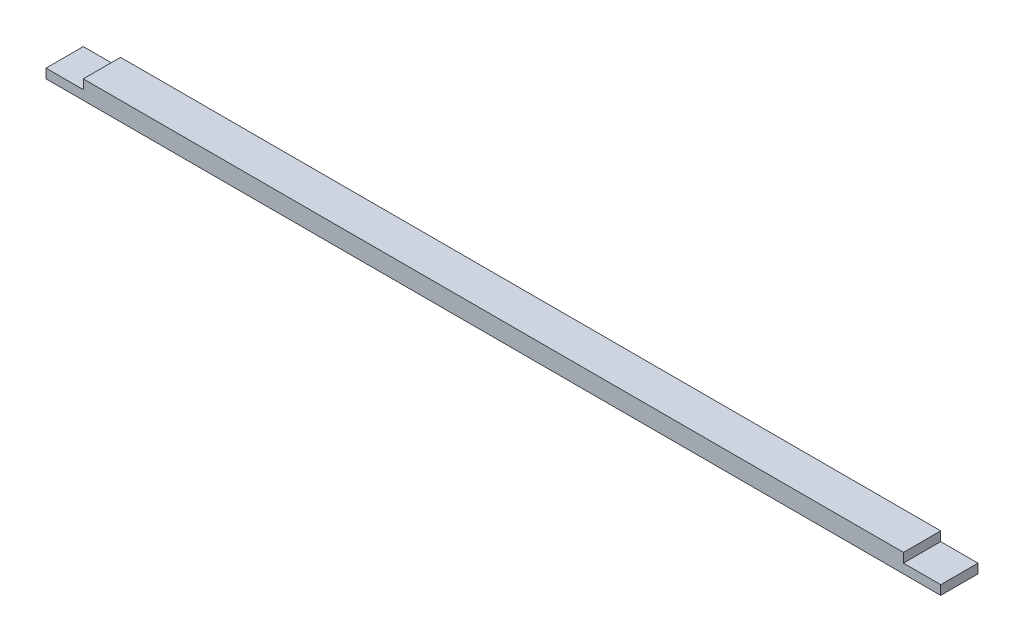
from build123d import *

# Parameters (mm, degrees)
SKETCH2_W           = 2438.4
SKETCH2_H           = 101.6
BOSS_EXTRUDE1_DEPTH = 50.8
SKETCH3_W           = 101.6
SKETCH3_H           = 101.6
CUT_EXTRUDE1_DEPTH  = 25.4


with BuildPart() as part:
    # Sketch2 → Boss-Extrude1 (new body)
    with BuildSketch(Plane(origin=(0, 0, 0), x_dir=(1, 0, 0), z_dir=(0, 1, 0))):
        with Locations((0, -1219.2)):
            Rectangle(SKETCH2_W, SKETCH2_H)
    extrude(amount=BOSS_EXTRUDE1_DEPTH)

    # Sketch3 → Cut-Extrude1 (cut)
    with BuildSketch(Plane(origin=(0, 50.8, 0), x_dir=(1, 0, 0), z_dir=(0, 1, 0))):
        with Locations((1168.4, -1219.2)):
            Rectangle(SKETCH3_W, SKETCH3_H)
    cut_extrude1 = extrude(amount=-CUT_EXTRUDE1_DEPTH, mode=Mode.SUBTRACT)

    # Mirror1: Cut-Extrude1 across plane
    add(cut_extrude1.mirror(Plane(origin=(0, 0, 0), x_dir=(0, 0, 1), z_dir=(1, 0, 0))), mode=Mode.SUBTRACT)


solid = part.part
